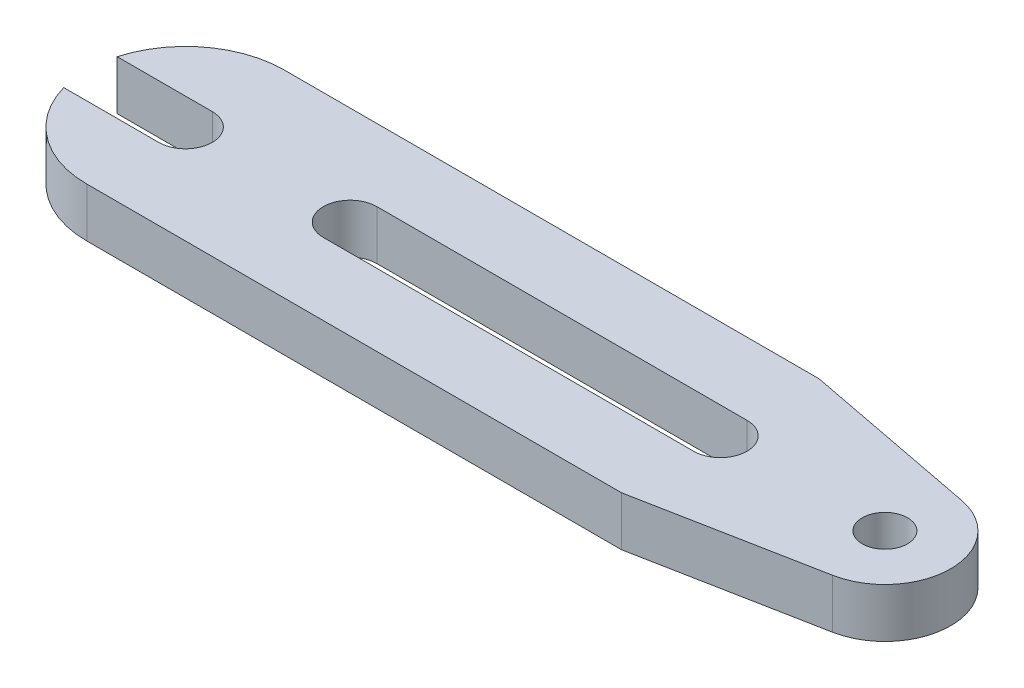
from build123d import *

# Parameters (mm, degrees)
SKETCH1_R      = 2.75
EXTRUDE1_DEPTH = 6


with BuildPart() as part:
    # Sketch1 → Extrude1 (new body)
    with BuildSketch(Plane(origin=(0, 0, 0), x_dir=(1, 0, 0), z_dir=(0, 1, 0))):
        with BuildLine():
            Line((0, 3.25), (-11.551515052, 3.25))
            ThreePointArc((-11.551515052, 3.25), (-7.245688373, 9.565563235), (0, 12))
            Line((0, 12), (65, 12))
            Line((65, 12), (86.5133357, 7.8555595))
            ThreePointArc((86.5133357, 7.8555595), (93, 0), (86.5133357, -7.8555595))
            Line((86.5133357, -7.8555595), (65, -12))
            Line((65, -12), (0, -12))
            ThreePointArc((0, -12), (-7.245688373, -9.565563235), (-11.551515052, -3.25))
            Line((-11.551515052, -3.25), (0, -3.25))
            ThreePointArc((0, -3.25), (3.25, 0), (0, 3.25))
        make_face()
        with Locations(Location((85, 0, 0), (0, 0, 270))):
            Circle(SKETCH1_R, mode=Mode.SUBTRACT)
        with BuildLine():
            Line((20, -3.25), (65, -3.25))
            ThreePointArc((65, -3.25), (68.25, 0), (65, 3.25))
            Line((65, 3.25), (20, 3.25))
            ThreePointArc((20, 3.25), (16.75, 0), (20, -3.25))
        make_face(mode=Mode.SUBTRACT)
    extrude(amount=EXTRUDE1_DEPTH)


solid = part.part
